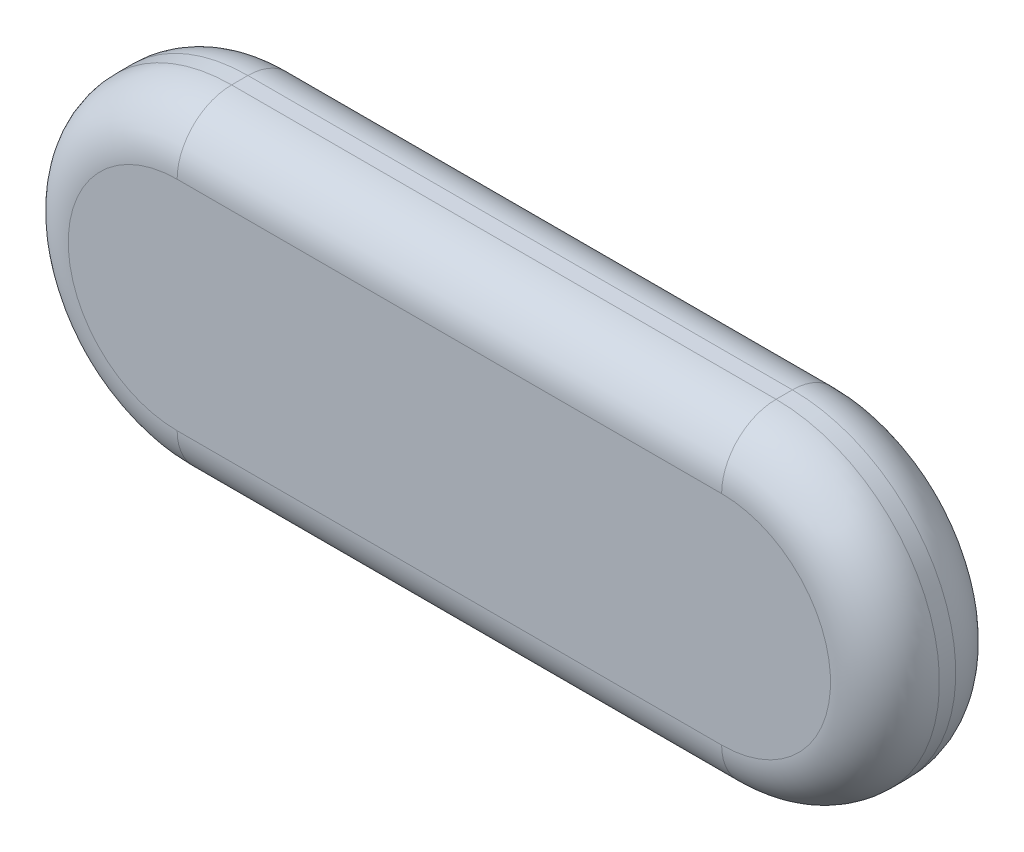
from build123d import *

# Parameters (mm, degrees)
BOSS_EXTRU_1_DEPTH      = 1
BOSS_EXTRU_1_DEPTH_BACK = 1.3
CONG_1_R                = 1


with BuildPart() as part:
    # Esquisse1 → Boss.-Extru.1 (new, two sides: drawn at the far end of the back side and taken through both)
    with BuildSketch(Plane.XY.offset(-BOSS_EXTRU_1_DEPTH_BACK)):
        with BuildLine():
            Line((-5, -26.375), (5, -26.375))
            ThreePointArc((5, -26.375), (8, -23.375), (5, -20.375))
            Line((5, -20.375), (-5, -20.375))
            ThreePointArc((-5, -20.375), (-8, -23.375), (-5, -26.375))
        make_face()
    extrude(amount=BOSS_EXTRU_1_DEPTH + BOSS_EXTRU_1_DEPTH_BACK)

    # Cong_1
    cong_1_edges = [part.edges().sort_by_distance(p)[0] for p in [
        (-8, -23.375, -1.3),
        (8, -23.375, 1),
        (0, -20.375, -1.3),
        (8, -23.375, -1.3),
        (0, -26.375, -1.3),
        (0, -20.375, 1),
        (-8, -23.375, 1),
        (0, -26.375, 1),
    ]]
    fillet(cong_1_edges, radius=CONG_1_R)


solid = part.part
